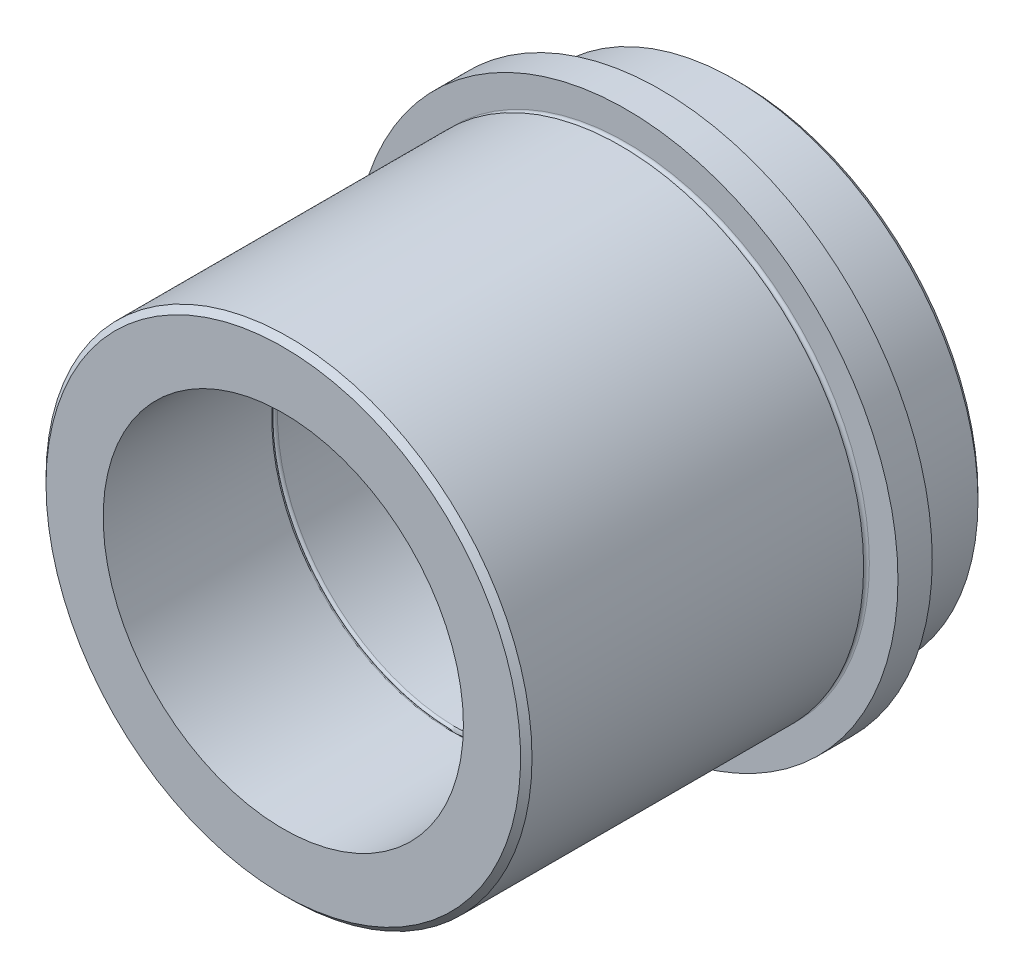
ISO-10303-21;
HEADER;
FILE_DESCRIPTION(('STEP AP214'),'2;1');
FILE_NAME('part.step','',(''),(''),'','','');
FILE_SCHEMA(('AUTOMOTIVE_DESIGN { 1 0 10303 214 1 1 1 1 }'));
ENDSEC;
DATA;
#1=APPLICATION_CONTEXT('core data for automotive mechanical design processes');
#2=APPLICATION_PROTOCOL_DEFINITION('international standard','automotive_design',2000,#1);
#3=PRODUCT_CONTEXT('',#1,'mechanical');
#4=PRODUCT('Part','Part','',(#3));
#5=PRODUCT_RELATED_PRODUCT_CATEGORY('part','',(#4));
#6=PRODUCT_DEFINITION_FORMATION('','',#4);
#7=PRODUCT_DEFINITION_CONTEXT('part definition',#1,'design');
#8=PRODUCT_DEFINITION('design','',#6,#7);
#9=PRODUCT_DEFINITION_SHAPE('','',#8);
#10=(LENGTH_UNIT() NAMED_UNIT(*) SI_UNIT(.MILLI.,.METRE.));
#11=(NAMED_UNIT(*) PLANE_ANGLE_UNIT() SI_UNIT($,.RADIAN.));
#12=(NAMED_UNIT(*) SI_UNIT($,.STERADIAN.) SOLID_ANGLE_UNIT());
#13=UNCERTAINTY_MEASURE_WITH_UNIT(LENGTH_MEASURE(1.E-05),#10,'distance_accuracy_value','');
#14=(GEOMETRIC_REPRESENTATION_CONTEXT(3) GLOBAL_UNCERTAINTY_ASSIGNED_CONTEXT((#13)) GLOBAL_UNIT_ASSIGNED_CONTEXT((#10,
#11,#12)) REPRESENTATION_CONTEXT('',''));
#15=CARTESIAN_POINT('',(0.,0.,0.));
#16=DIRECTION('',(0.,0.,1.));
#17=DIRECTION('',(1.,0.,0.));
#18=AXIS2_PLACEMENT_3D('',#15,#16,#17);
#19=CARTESIAN_POINT('',(0.,0.,0.));
#20=DIRECTION('',(0.,0.,1.));
#21=DIRECTION('',(1.,0.,0.));
#22=AXIS2_PLACEMENT_3D('',#19,#20,#21);
#23=CYLINDRICAL_SURFACE('',#22,31.5);
#24=CARTESIAN_POINT('',(0.,0.,-29.5));
#25=DIRECTION('',(0.,0.,1.));
#26=DIRECTION('',(1.,0.,0.));
#27=AXIS2_PLACEMENT_3D('',#24,#25,#26);
#28=CIRCLE('',#27,31.5);
#29=CARTESIAN_POINT('',(31.5,0.,-29.5));
#30=VERTEX_POINT('',#29);
#31=EDGE_CURVE('E69',#30,#30,#28,.T.);
#32=ORIENTED_EDGE('',*,*,#31,.F.);
#33=EDGE_LOOP('',(#32));
#34=FACE_BOUND('',#33,.T.);
#35=CARTESIAN_POINT('',(0.,0.,0.));
#36=DIRECTION('',(0.,0.,1.));
#37=DIRECTION('',(1.,0.,0.));
#38=AXIS2_PLACEMENT_3D('',#35,#36,#37);
#39=CIRCLE('',#38,31.5);
#40=CARTESIAN_POINT('',(31.5,0.,0.));
#41=VERTEX_POINT('',#40);
#42=EDGE_CURVE('E33',#41,#41,#39,.T.);
#43=ORIENTED_EDGE('',*,*,#42,.T.);
#44=EDGE_LOOP('',(#43));
#45=FACE_BOUND('',#44,.T.);
#46=ADVANCED_FACE('F13',(#34,#45),#23,.F.);
#47=CARTESIAN_POINT('',(0.,31.5,0.));
#48=DIRECTION('',(0.,0.,-1.));
#49=DIRECTION('',(-1.,0.,0.));
#50=AXIS2_PLACEMENT_3D('',#47,#48,#49);
#51=PLANE('',#50);
#52=CARTESIAN_POINT('',(0.,0.,0.));
#53=DIRECTION('',(0.,0.,-1.));
#54=DIRECTION('',(-1.,0.,0.));
#55=AXIS2_PLACEMENT_3D('',#52,#53,#54);
#56=CIRCLE('',#55,41.5);
#57=CARTESIAN_POINT('',(-41.5,0.,0.));
#58=VERTEX_POINT('',#57);
#59=EDGE_CURVE('E20',#58,#58,#56,.F.);
#60=ORIENTED_EDGE('',*,*,#59,.T.);
#61=EDGE_LOOP('',(#60));
#62=FACE_BOUND('',#61,.T.);
#63=ORIENTED_EDGE('',*,*,#42,.F.);
#64=EDGE_LOOP('',(#63));
#65=FACE_BOUND('',#64,.T.);
#66=ADVANCED_FACE('F77',(#62,#65),#51,.F.);
#67=CARTESIAN_POINT('',(0.,0.,0.));
#68=DIRECTION('',(0.,0.,1.));
#69=DIRECTION('',(1.,0.,0.));
#70=AXIS2_PLACEMENT_3D('',#67,#68,#69);
#71=CYLINDRICAL_SURFACE('',#70,42.5);
#72=CARTESIAN_POINT('',(0.,0.,-1.));
#73=DIRECTION('',(0.,0.,-1.));
#74=DIRECTION('',(-1.,0.,0.));
#75=AXIS2_PLACEMENT_3D('',#72,#73,#74);
#76=CIRCLE('',#75,42.5);
#77=CARTESIAN_POINT('',(-42.5,0.,-1.));
#78=VERTEX_POINT('',#77);
#79=EDGE_CURVE('E8',#78,#78,#76,.T.);
#80=ORIENTED_EDGE('',*,*,#79,.T.);
#81=EDGE_LOOP('',(#80));
#82=FACE_BOUND('',#81,.T.);
#83=CARTESIAN_POINT('',(0.,0.,-59.));
#84=DIRECTION('',(0.,0.,1.));
#85=DIRECTION('',(1.,0.,0.));
#86=AXIS2_PLACEMENT_3D('',#83,#84,#85);
#87=CIRCLE('',#86,42.5);
#88=CARTESIAN_POINT('',(42.5,0.,-59.));
#89=VERTEX_POINT('',#88);
#90=EDGE_CURVE('E36',#89,#89,#87,.T.);
#91=ORIENTED_EDGE('',*,*,#90,.T.);
#92=EDGE_LOOP('',(#91));
#93=FACE_BOUND('',#92,.T.);
#94=ADVANCED_FACE('F82',(#82,#93),#71,.T.);
#95=CARTESIAN_POINT('',(0.,0.,-59.5));
#96=DIRECTION('',(0.,0.,1.));
#97=DIRECTION('',(1.,0.,0.));
#98=AXIS2_PLACEMENT_3D('',#95,#96,#97);
#99=TOROIDAL_SURFACE('',#98,42.5,0.5);
#100=ORIENTED_EDGE('',*,*,#90,.F.);
#101=EDGE_LOOP('',(#100));
#102=FACE_BOUND('',#101,.T.);
#103=CARTESIAN_POINT('',(0.,0.,-60.));
#104=DIRECTION('',(0.,0.,1.));
#105=DIRECTION('',(1.,0.,0.));
#106=AXIS2_PLACEMENT_3D('',#103,#104,#105);
#107=CIRCLE('',#106,42.5);
#108=CARTESIAN_POINT('',(42.5,0.,-60.));
#109=VERTEX_POINT('',#108);
#110=EDGE_CURVE('E39',#109,#109,#107,.T.);
#111=ORIENTED_EDGE('',*,*,#110,.T.);
#112=EDGE_LOOP('',(#111));
#113=FACE_BOUND('',#112,.T.);
#114=ADVANCED_FACE('F89',(#102,#113),#99,.F.);
#115=CARTESIAN_POINT('',(0.,42.5,-60.));
#116=DIRECTION('',(0.,0.,-1.));
#117=DIRECTION('',(-1.,0.,0.));
#118=AXIS2_PLACEMENT_3D('',#115,#116,#117);
#119=PLANE('',#118);
#120=ORIENTED_EDGE('',*,*,#110,.F.);
#121=EDGE_LOOP('',(#120));
#122=FACE_BOUND('',#121,.T.);
#123=CARTESIAN_POINT('',(0.,0.,-60.));
#124=DIRECTION('',(0.,0.,1.));
#125=DIRECTION('',(1.,0.,0.));
#126=AXIS2_PLACEMENT_3D('',#123,#124,#125);
#127=CIRCLE('',#126,47.5);
#128=CARTESIAN_POINT('',(47.5,0.,-60.));
#129=VERTEX_POINT('',#128);
#130=EDGE_CURVE('E42',#129,#129,#127,.T.);
#131=ORIENTED_EDGE('',*,*,#130,.T.);
#132=EDGE_LOOP('',(#131));
#133=FACE_BOUND('',#132,.T.);
#134=ADVANCED_FACE('F124',(#122,#133),#119,.F.);
#135=CARTESIAN_POINT('',(0.,0.,0.));
#136=DIRECTION('',(0.,0.,1.));
#137=DIRECTION('',(1.,0.,0.));
#138=AXIS2_PLACEMENT_3D('',#135,#136,#137);
#139=CYLINDRICAL_SURFACE('',#138,47.5);
#140=ORIENTED_EDGE('',*,*,#130,.F.);
#141=EDGE_LOOP('',(#140));
#142=FACE_BOUND('',#141,.T.);
#143=CARTESIAN_POINT('',(0.,0.,-66.));
#144=DIRECTION('',(0.,0.,1.));
#145=DIRECTION('',(1.,0.,0.));
#146=AXIS2_PLACEMENT_3D('',#143,#144,#145);
#147=CIRCLE('',#146,47.5);
#148=CARTESIAN_POINT('',(47.5,0.,-66.));
#149=VERTEX_POINT('',#148);
#150=EDGE_CURVE('E45',#149,#149,#147,.T.);
#151=ORIENTED_EDGE('',*,*,#150,.T.);
#152=EDGE_LOOP('',(#151));
#153=FACE_BOUND('',#152,.T.);
#154=ADVANCED_FACE('F117',(#142,#153),#139,.T.);
#155=CARTESIAN_POINT('',(0.,47.5,-66.));
#156=DIRECTION('',(0.,0.,1.));
#157=DIRECTION('',(1.,0.,0.));
#158=AXIS2_PLACEMENT_3D('',#155,#156,#157);
#159=PLANE('',#158);
#160=ORIENTED_EDGE('',*,*,#150,.F.);
#161=EDGE_LOOP('',(#160));
#162=FACE_BOUND('',#161,.T.);
#163=CARTESIAN_POINT('',(0.,0.,-66.));
#164=DIRECTION('',(0.,0.,1.));
#165=DIRECTION('',(1.,0.,0.));
#166=AXIS2_PLACEMENT_3D('',#163,#164,#165);
#167=CIRCLE('',#166,42.5);
#168=CARTESIAN_POINT('',(42.5,0.,-66.));
#169=VERTEX_POINT('',#168);
#170=EDGE_CURVE('E48',#169,#169,#167,.T.);
#171=ORIENTED_EDGE('',*,*,#170,.T.);
#172=EDGE_LOOP('',(#171));
#173=FACE_BOUND('',#172,.T.);
#174=ADVANCED_FACE('F112',(#162,#173),#159,.F.);
#175=CARTESIAN_POINT('',(0.,0.,0.));
#176=DIRECTION('',(0.,0.,1.));
#177=DIRECTION('',(1.,0.,0.));
#178=AXIS2_PLACEMENT_3D('',#175,#176,#177);
#179=CYLINDRICAL_SURFACE('',#178,42.5);
#180=CARTESIAN_POINT('',(0.,0.,-79.));
#181=DIRECTION('',(0.,0.,1.));
#182=DIRECTION('',(1.,0.,0.));
#183=AXIS2_PLACEMENT_3D('',#180,#181,#182);
#184=CIRCLE('',#183,42.5);
#185=CARTESIAN_POINT('',(42.5,0.,-79.));
#186=VERTEX_POINT('',#185);
#187=EDGE_CURVE('E28',#186,#186,#184,.T.);
#188=ORIENTED_EDGE('',*,*,#187,.T.);
#189=EDGE_LOOP('',(#188));
#190=FACE_BOUND('',#189,.T.);
#191=ORIENTED_EDGE('',*,*,#170,.F.);
#192=EDGE_LOOP('',(#191));
#193=FACE_BOUND('',#192,.T.);
#194=ADVANCED_FACE('F108',(#190,#193),#179,.T.);
#195=CARTESIAN_POINT('',(0.,42.5,-80.));
#196=DIRECTION('',(0.,0.,1.));
#197=DIRECTION('',(1.,0.,0.));
#198=AXIS2_PLACEMENT_3D('',#195,#196,#197);
#199=PLANE('',#198);
#200=CARTESIAN_POINT('',(0.,0.,-80.));
#201=DIRECTION('',(0.,0.,1.));
#202=DIRECTION('',(1.,0.,0.));
#203=AXIS2_PLACEMENT_3D('',#200,#201,#202);
#204=CIRCLE('',#203,41.5);
#205=CARTESIAN_POINT('',(41.5,0.,-80.));
#206=VERTEX_POINT('',#205);
#207=EDGE_CURVE('E24',#206,#206,#204,.F.);
#208=ORIENTED_EDGE('',*,*,#207,.T.);
#209=EDGE_LOOP('',(#208));
#210=FACE_BOUND('',#209,.T.);
#211=CARTESIAN_POINT('',(0.,0.,-80.));
#212=DIRECTION('',(0.,0.,1.));
#213=DIRECTION('',(1.,0.,0.));
#214=AXIS2_PLACEMENT_3D('',#211,#212,#213);
#215=CIRCLE('',#214,31.5);
#216=CARTESIAN_POINT('',(31.5,0.,-80.));
#217=VERTEX_POINT('',#216);
#218=EDGE_CURVE('E51',#217,#217,#215,.T.);
#219=ORIENTED_EDGE('',*,*,#218,.T.);
#220=EDGE_LOOP('',(#219));
#221=FACE_BOUND('',#220,.T.);
#222=ADVANCED_FACE('F111',(#210,#221),#199,.F.);
#223=CARTESIAN_POINT('',(0.,0.,0.));
#224=DIRECTION('',(0.,0.,1.));
#225=DIRECTION('',(1.,0.,0.));
#226=AXIS2_PLACEMENT_3D('',#223,#224,#225);
#227=CYLINDRICAL_SURFACE('',#226,31.5);
#228=ORIENTED_EDGE('',*,*,#218,.F.);
#229=EDGE_LOOP('',(#228));
#230=FACE_BOUND('',#229,.T.);
#231=CARTESIAN_POINT('',(0.,0.,-60.5));
#232=DIRECTION('',(0.,0.,1.));
#233=DIRECTION('',(1.,0.,0.));
#234=AXIS2_PLACEMENT_3D('',#231,#232,#233);
#235=CIRCLE('',#234,31.5);
#236=CARTESIAN_POINT('',(31.5,0.,-60.5));
#237=VERTEX_POINT('',#236);
#238=EDGE_CURVE('E54',#237,#237,#235,.T.);
#239=ORIENTED_EDGE('',*,*,#238,.T.);
#240=EDGE_LOOP('',(#239));
#241=FACE_BOUND('',#240,.T.);
#242=ADVANCED_FACE('F241',(#230,#241),#227,.F.);
#243=CARTESIAN_POINT('',(0.,0.,-60.5));
#244=DIRECTION('',(0.,0.,1.));
#245=DIRECTION('',(1.,0.,0.));
#246=AXIS2_PLACEMENT_3D('',#243,#244,#245);
#247=TOROIDAL_SURFACE('',#246,32.,0.5);
#248=ORIENTED_EDGE('',*,*,#238,.F.);
#249=EDGE_LOOP('',(#248));
#250=FACE_BOUND('',#249,.T.);
#251=CARTESIAN_POINT('',(0.,0.,-60.));
#252=DIRECTION('',(0.,0.,1.));
#253=DIRECTION('',(1.,0.,0.));
#254=AXIS2_PLACEMENT_3D('',#251,#252,#253);
#255=CIRCLE('',#254,32.);
#256=CARTESIAN_POINT('',(32.,0.,-60.));
#257=VERTEX_POINT('',#256);
#258=EDGE_CURVE('E57',#257,#257,#255,.T.);
#259=ORIENTED_EDGE('',*,*,#258,.T.);
#260=EDGE_LOOP('',(#259));
#261=FACE_BOUND('',#260,.T.);
#262=ADVANCED_FACE('F232',(#250,#261),#247,.T.);
#263=CARTESIAN_POINT('',(0.,0.,-59.5));
#264=DIRECTION('',(0.,0.,1.));
#265=DIRECTION('',(1.,0.,0.));
#266=AXIS2_PLACEMENT_3D('',#263,#264,#265);
#267=TOROIDAL_SURFACE('',#266,32.,0.5);
#268=ORIENTED_EDGE('',*,*,#258,.F.);
#269=EDGE_LOOP('',(#268));
#270=FACE_BOUND('',#269,.T.);
#271=CARTESIAN_POINT('',(0.,0.,-59.5));
#272=DIRECTION('',(0.,0.,1.));
#273=DIRECTION('',(1.,0.,0.));
#274=AXIS2_PLACEMENT_3D('',#271,#272,#273);
#275=CIRCLE('',#274,31.5);
#276=CARTESIAN_POINT('',(31.5,0.,-59.5));
#277=VERTEX_POINT('',#276);
#278=EDGE_CURVE('E60',#277,#277,#275,.T.);
#279=ORIENTED_EDGE('',*,*,#278,.T.);
#280=EDGE_LOOP('',(#279));
#281=FACE_BOUND('',#280,.T.);
#282=ADVANCED_FACE('F223',(#270,#281),#267,.T.);
#283=CARTESIAN_POINT('',(0.,0.,0.));
#284=DIRECTION('',(0.,0.,1.));
#285=DIRECTION('',(1.,0.,0.));
#286=AXIS2_PLACEMENT_3D('',#283,#284,#285);
#287=CYLINDRICAL_SURFACE('',#286,31.5);
#288=ORIENTED_EDGE('',*,*,#278,.F.);
#289=EDGE_LOOP('',(#288));
#290=FACE_BOUND('',#289,.T.);
#291=CARTESIAN_POINT('',(0.,0.,-30.5));
#292=DIRECTION('',(0.,0.,1.));
#293=DIRECTION('',(1.,0.,0.));
#294=AXIS2_PLACEMENT_3D('',#291,#292,#293);
#295=CIRCLE('',#294,31.5);
#296=CARTESIAN_POINT('',(31.5,0.,-30.5));
#297=VERTEX_POINT('',#296);
#298=EDGE_CURVE('E63',#297,#297,#295,.T.);
#299=ORIENTED_EDGE('',*,*,#298,.T.);
#300=EDGE_LOOP('',(#299));
#301=FACE_BOUND('',#300,.T.);
#302=ADVANCED_FACE('F214',(#290,#301),#287,.F.);
#303=CARTESIAN_POINT('',(0.,0.,-30.5));
#304=DIRECTION('',(0.,0.,1.));
#305=DIRECTION('',(1.,0.,0.));
#306=AXIS2_PLACEMENT_3D('',#303,#304,#305);
#307=TOROIDAL_SURFACE('',#306,32.,0.5);
#308=ORIENTED_EDGE('',*,*,#298,.F.);
#309=EDGE_LOOP('',(#308));
#310=FACE_BOUND('',#309,.T.);
#311=CARTESIAN_POINT('',(0.,0.,-30.));
#312=DIRECTION('',(0.,0.,1.));
#313=DIRECTION('',(1.,0.,0.));
#314=AXIS2_PLACEMENT_3D('',#311,#312,#313);
#315=CIRCLE('',#314,32.);
#316=CARTESIAN_POINT('',(32.,0.,-30.));
#317=VERTEX_POINT('',#316);
#318=EDGE_CURVE('E66',#317,#317,#315,.T.);
#319=ORIENTED_EDGE('',*,*,#318,.T.);
#320=EDGE_LOOP('',(#319));
#321=FACE_BOUND('',#320,.T.);
#322=ADVANCED_FACE('F101',(#310,#321),#307,.T.);
#323=CARTESIAN_POINT('',(0.,0.,-29.5));
#324=DIRECTION('',(0.,0.,1.));
#325=DIRECTION('',(1.,0.,0.));
#326=AXIS2_PLACEMENT_3D('',#323,#324,#325);
#327=TOROIDAL_SURFACE('',#326,32.,0.5);
#328=ORIENTED_EDGE('',*,*,#318,.F.);
#329=EDGE_LOOP('',(#328));
#330=FACE_BOUND('',#329,.T.);
#331=ORIENTED_EDGE('',*,*,#31,.T.);
#332=EDGE_LOOP('',(#331));
#333=FACE_BOUND('',#332,.T.);
#334=ADVANCED_FACE('F73',(#330,#333),#327,.T.);
#335=CARTESIAN_POINT('',(0.,0.,-79.));
#336=DIRECTION('',(0.,0.,1.));
#337=DIRECTION('',(1.,0.,0.));
#338=AXIS2_PLACEMENT_3D('',#335,#336,#337);
#339=CONICAL_SURFACE('',#338,42.5,0.785398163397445);
#340=ORIENTED_EDGE('',*,*,#207,.F.);
#341=EDGE_LOOP('',(#340));
#342=FACE_BOUND('',#341,.T.);
#343=ORIENTED_EDGE('',*,*,#187,.F.);
#344=EDGE_LOOP('',(#343));
#345=FACE_BOUND('',#344,.T.);
#346=ADVANCED_FACE('F92',(#342,#345),#339,.T.);
#347=CARTESIAN_POINT('',(0.,0.,0.));
#348=DIRECTION('',(0.,0.,-1.));
#349=DIRECTION('',(-1.,0.,0.));
#350=AXIS2_PLACEMENT_3D('',#347,#348,#349);
#351=CONICAL_SURFACE('',#350,41.5,0.785398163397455);
#352=ORIENTED_EDGE('',*,*,#79,.F.);
#353=EDGE_LOOP('',(#352));
#354=FACE_BOUND('',#353,.T.);
#355=ORIENTED_EDGE('',*,*,#59,.F.);
#356=EDGE_LOOP('',(#355));
#357=FACE_BOUND('',#356,.T.);
#358=ADVANCED_FACE('F15',(#354,#357),#351,.T.);
#359=CLOSED_SHELL('',(#46,#66,#94,#114,#134,#154,#174,#194,#222,#242,#262,#282,#302,#322,#334,
#346,#358));
#360=MANIFOLD_SOLID_BREP('B1',#359);
#361=ADVANCED_BREP_SHAPE_REPRESENTATION('',(#18,#360),#14);
#362=SHAPE_DEFINITION_REPRESENTATION(#9,#361);
ENDSEC;
END-ISO-10303-21;
